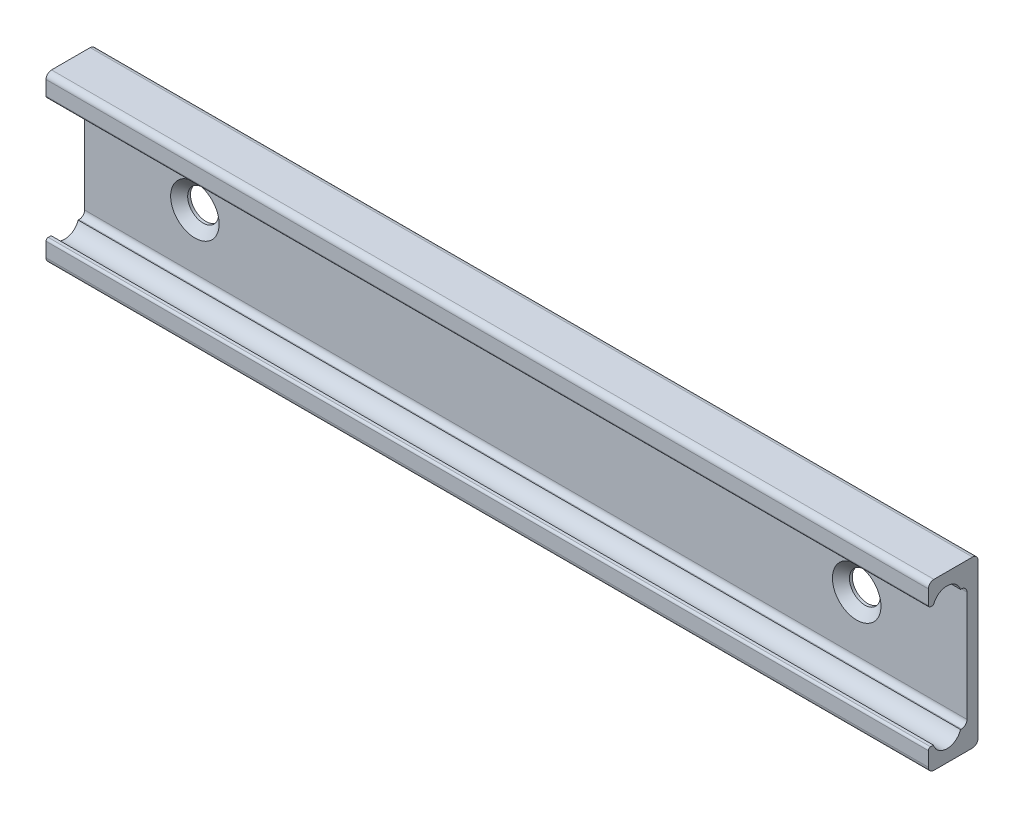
ISO-10303-21;
HEADER;
FILE_DESCRIPTION(('STEP AP214'),'2;1');
FILE_NAME('part.step','',(''),(''),'','','');
FILE_SCHEMA(('AUTOMOTIVE_DESIGN { 1 0 10303 214 1 1 1 1 }'));
ENDSEC;
DATA;
#1=APPLICATION_CONTEXT('core data for automotive mechanical design processes');
#2=APPLICATION_PROTOCOL_DEFINITION('international standard','automotive_design',2000,#1);
#3=PRODUCT_CONTEXT('',#1,'mechanical');
#4=PRODUCT('Part','Part','',(#3));
#5=PRODUCT_RELATED_PRODUCT_CATEGORY('part','',(#4));
#6=PRODUCT_DEFINITION_FORMATION('','',#4);
#7=PRODUCT_DEFINITION_CONTEXT('part definition',#1,'design');
#8=PRODUCT_DEFINITION('design','',#6,#7);
#9=PRODUCT_DEFINITION_SHAPE('','',#8);
#10=(LENGTH_UNIT() NAMED_UNIT(*) SI_UNIT(.MILLI.,.METRE.));
#11=(NAMED_UNIT(*) PLANE_ANGLE_UNIT() SI_UNIT($,.RADIAN.));
#12=(NAMED_UNIT(*) SI_UNIT($,.STERADIAN.) SOLID_ANGLE_UNIT());
#13=UNCERTAINTY_MEASURE_WITH_UNIT(LENGTH_MEASURE(1.E-05),#10,'distance_accuracy_value','');
#14=(GEOMETRIC_REPRESENTATION_CONTEXT(3) GLOBAL_UNCERTAINTY_ASSIGNED_CONTEXT((#13)) GLOBAL_UNIT_ASSIGNED_CONTEXT((#10,
#11,#12)) REPRESENTATION_CONTEXT('',''));
#15=CARTESIAN_POINT('',(0.,0.,0.));
#16=DIRECTION('',(0.,0.,1.));
#17=DIRECTION('',(1.,0.,0.));
#18=AXIS2_PLACEMENT_3D('',#15,#16,#17);
#19=CARTESIAN_POINT('',(70.,5.69999999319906,4.5));
#20=DIRECTION('',(0.,0.,1.));
#21=DIRECTION('',(1.,0.,0.));
#22=AXIS2_PLACEMENT_3D('',#19,#20,#21);
#23=PLANE('',#22);
#24=DIRECTION('',(0.,1.,0.));
#25=VECTOR('',#24,1.);
#26=CARTESIAN_POINT('',(-10.,5.69999999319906,4.5));
#27=LINE('',#26,#25);
#28=CARTESIAN_POINT('',(-10.,5.69999999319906,4.5));
#29=VERTEX_POINT('',#28);
#30=CARTESIAN_POINT('',(-10.,7.,4.5));
#31=VERTEX_POINT('',#30);
#32=EDGE_CURVE('E258',#29,#31,#27,.T.);
#33=ORIENTED_EDGE('',*,*,#32,.F.);
#34=DIRECTION('',(-1.,0.,0.));
#35=VECTOR('',#34,1.);
#36=CARTESIAN_POINT('',(70.,5.69999999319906,4.5));
#37=LINE('',#36,#35);
#38=CARTESIAN_POINT('',(70.,5.69999999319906,4.5));
#39=VERTEX_POINT('',#38);
#40=EDGE_CURVE('E9',#39,#29,#37,.T.);
#41=ORIENTED_EDGE('',*,*,#40,.F.);
#42=DIRECTION('',(0.,1.,0.));
#43=VECTOR('',#42,1.);
#44=CARTESIAN_POINT('',(70.,5.69999999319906,4.5));
#45=LINE('',#44,#43);
#46=CARTESIAN_POINT('',(70.,7.,4.5));
#47=VERTEX_POINT('',#46);
#48=EDGE_CURVE('E197',#39,#47,#45,.T.);
#49=ORIENTED_EDGE('',*,*,#48,.T.);
#50=DIRECTION('',(-1.,0.,0.));
#51=VECTOR('',#50,1.);
#52=CARTESIAN_POINT('',(74.5334865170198,7.,4.5));
#53=LINE('',#52,#51);
#54=EDGE_CURVE('E302',#47,#31,#53,.T.);
#55=ORIENTED_EDGE('',*,*,#54,.T.);
#56=EDGE_LOOP('',(#33,#41,#49,#55));
#57=FACE_BOUND('',#56,.T.);
#58=ADVANCED_FACE('F14',(#57),#23,.T.);
#59=CARTESIAN_POINT('',(70.,5.69999999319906,4.3));
#60=DIRECTION('',(-1.,0.,0.));
#61=DIRECTION('',(0.,0.,1.));
#62=AXIS2_PLACEMENT_3D('',#59,#60,#61);
#63=CYLINDRICAL_SURFACE('',#62,0.2);
#64=CARTESIAN_POINT('',(-10.,5.69999999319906,4.3));
#65=DIRECTION('',(-1.,0.,0.));
#66=DIRECTION('',(0.,0.,-1.));
#67=AXIS2_PLACEMENT_3D('',#64,#65,#66);
#68=CIRCLE('',#67,0.2);
#69=CARTESIAN_POINT('',(-10.,5.49999999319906,4.3));
#70=VERTEX_POINT('',#69);
#71=EDGE_CURVE('E255',#70,#29,#68,.T.);
#72=ORIENTED_EDGE('',*,*,#71,.F.);
#73=DIRECTION('',(-1.,0.,0.));
#74=VECTOR('',#73,1.);
#75=CARTESIAN_POINT('',(70.,5.49999999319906,4.3));
#76=LINE('',#75,#74);
#77=CARTESIAN_POINT('',(70.,5.49999999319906,4.3));
#78=VERTEX_POINT('',#77);
#79=EDGE_CURVE('E23',#78,#70,#76,.T.);
#80=ORIENTED_EDGE('',*,*,#79,.F.);
#81=CARTESIAN_POINT('',(70.,5.69999999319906,4.3));
#82=DIRECTION('',(-1.,0.,0.));
#83=DIRECTION('',(0.,0.,-1.));
#84=AXIS2_PLACEMENT_3D('',#81,#82,#83);
#85=CIRCLE('',#84,0.2);
#86=EDGE_CURVE('E194',#78,#39,#85,.T.);
#87=ORIENTED_EDGE('',*,*,#86,.T.);
#88=ORIENTED_EDGE('',*,*,#40,.T.);
#89=EDGE_LOOP('',(#72,#80,#87,#88));
#90=FACE_BOUND('',#89,.T.);
#91=ADVANCED_FACE('F352',(#90),#63,.T.);
#92=CARTESIAN_POINT('',(70.,5.49999999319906,3.97687617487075));
#93=DIRECTION('',(0.,-1.,0.));
#94=DIRECTION('',(1.,0.,0.));
#95=AXIS2_PLACEMENT_3D('',#92,#93,#94);
#96=PLANE('',#95);
#97=DIRECTION('',(-1.,0.,0.));
#98=VECTOR('',#97,1.);
#99=CARTESIAN_POINT('',(70.,5.49999999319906,4.03641754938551));
#100=LINE('',#99,#98);
#101=CARTESIAN_POINT('',(70.,5.49999999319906,4.03641754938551));
#102=VERTEX_POINT('',#101);
#103=CARTESIAN_POINT('',(-10.,5.49999999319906,4.03641754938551));
#104=VERTEX_POINT('',#103);
#105=EDGE_CURVE('E31',#102,#104,#100,.T.);
#106=ORIENTED_EDGE('',*,*,#105,.F.);
#107=DIRECTION('',(0.,0.,1.));
#108=VECTOR('',#107,1.);
#109=CARTESIAN_POINT('',(70.,5.49999999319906,3.97687617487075));
#110=LINE('',#109,#108);
#111=EDGE_CURVE('E192',#102,#78,#110,.T.);
#112=ORIENTED_EDGE('',*,*,#111,.T.);
#113=ORIENTED_EDGE('',*,*,#79,.T.);
#114=DIRECTION('',(0.,0.,1.));
#115=VECTOR('',#114,1.);
#116=CARTESIAN_POINT('',(-10.,5.49999999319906,3.97687617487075));
#117=LINE('',#116,#115);
#118=EDGE_CURVE('E253',#104,#70,#117,.T.);
#119=ORIENTED_EDGE('',*,*,#118,.F.);
#120=EDGE_LOOP('',(#106,#112,#113,#119));
#121=FACE_BOUND('',#120,.T.);
#122=ADVANCED_FACE('F359',(#121),#96,.T.);
#123=CARTESIAN_POINT('',(70.,5.5,1.5));
#124=DIRECTION('',(0.,-1.,-4.7517935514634E-08));
#125=DIRECTION('',(0.,-4.7517935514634E-08,1.));
#126=AXIS2_PLACEMENT_3D('',#123,#124,#125);
#127=PLANE('',#126);
#128=DIRECTION('',(-1.,0.,0.));
#129=VECTOR('',#128,1.);
#130=CARTESIAN_POINT('',(70.,5.49999999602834,1.58358245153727));
#131=LINE('',#130,#129);
#132=CARTESIAN_POINT('',(-10.,5.49999999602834,1.58358245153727));
#133=VERTEX_POINT('',#132);
#134=CARTESIAN_POINT('',(70.,5.49999999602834,1.58358245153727));
#135=VERTEX_POINT('',#134);
#136=EDGE_CURVE('E168',#133,#135,#131,.F.);
#137=ORIENTED_EDGE('',*,*,#136,.F.);
#138=DIRECTION('',(0.,-4.7517935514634E-08,1.));
#139=VECTOR('',#138,1.);
#140=CARTESIAN_POINT('',(-10.,5.5,1.5));
#141=LINE('',#140,#139);
#142=CARTESIAN_POINT('',(-10.,5.5,1.5));
#143=VERTEX_POINT('',#142);
#144=EDGE_CURVE('E250',#143,#133,#141,.T.);
#145=ORIENTED_EDGE('',*,*,#144,.F.);
#146=DIRECTION('',(-1.,0.,0.));
#147=VECTOR('',#146,1.);
#148=CARTESIAN_POINT('',(70.,5.5,1.5));
#149=LINE('',#148,#147);
#150=CARTESIAN_POINT('',(70.,5.5,1.5));
#151=VERTEX_POINT('',#150);
#152=EDGE_CURVE('E202',#151,#143,#149,.T.);
#153=ORIENTED_EDGE('',*,*,#152,.F.);
#154=DIRECTION('',(0.,-4.7517935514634E-08,1.));
#155=VECTOR('',#154,1.);
#156=CARTESIAN_POINT('',(70.,5.5,1.5));
#157=LINE('',#156,#155);
#158=EDGE_CURVE('E189',#151,#135,#157,.T.);
#159=ORIENTED_EDGE('',*,*,#158,.T.);
#160=EDGE_LOOP('',(#137,#145,#153,#159));
#161=FACE_BOUND('',#160,.T.);
#162=ADVANCED_FACE('F368',(#161),#127,.T.);
#163=CARTESIAN_POINT('',(70.,5.,1.5));
#164=DIRECTION('',(-1.,0.,0.));
#165=DIRECTION('',(0.,0.,1.));
#166=AXIS2_PLACEMENT_3D('',#163,#164,#165);
#167=CYLINDRICAL_SURFACE('',#166,0.5);
#168=CARTESIAN_POINT('',(-10.,5.,1.5));
#169=DIRECTION('',(1.,0.,0.));
#170=DIRECTION('',(0.,0.,1.));
#171=AXIS2_PLACEMENT_3D('',#168,#169,#170);
#172=CIRCLE('',#171,0.5);
#173=CARTESIAN_POINT('',(-10.,5.,1.));
#174=VERTEX_POINT('',#173);
#175=EDGE_CURVE('E247',#174,#143,#172,.T.);
#176=ORIENTED_EDGE('',*,*,#175,.F.);
#177=DIRECTION('',(-1.,0.,0.));
#178=VECTOR('',#177,1.);
#179=CARTESIAN_POINT('',(70.,5.,1.));
#180=LINE('',#179,#178);
#181=CARTESIAN_POINT('',(70.,5.,1.));
#182=VERTEX_POINT('',#181);
#183=EDGE_CURVE('E204',#182,#174,#180,.T.);
#184=ORIENTED_EDGE('',*,*,#183,.F.);
#185=CARTESIAN_POINT('',(70.,5.,1.5));
#186=DIRECTION('',(1.,0.,0.));
#187=DIRECTION('',(0.,0.,1.));
#188=AXIS2_PLACEMENT_3D('',#185,#186,#187);
#189=CIRCLE('',#188,0.5);
#190=EDGE_CURVE('E186',#182,#151,#189,.T.);
#191=ORIENTED_EDGE('',*,*,#190,.T.);
#192=ORIENTED_EDGE('',*,*,#152,.T.);
#193=EDGE_LOOP('',(#176,#184,#191,#192));
#194=FACE_BOUND('',#193,.T.);
#195=ADVANCED_FACE('F372',(#194),#167,.F.);
#196=CARTESIAN_POINT('',(70.,-5.,1.));
#197=DIRECTION('',(0.,0.,1.));
#198=DIRECTION('',(1.,0.,0.));
#199=AXIS2_PLACEMENT_3D('',#196,#197,#198);
#200=PLANE('',#199);
#201=CARTESIAN_POINT('',(60.,0.,1.));
#202=DIRECTION('',(0.,0.,1.));
#203=DIRECTION('',(1.,0.,0.));
#204=AXIS2_PLACEMENT_3D('',#201,#202,#203);
#205=CIRCLE('',#204,2.2);
#206=CARTESIAN_POINT('',(62.2,0.,1.));
#207=VERTEX_POINT('',#206);
#208=EDGE_CURVE('E222',#207,#207,#205,.T.);
#209=ORIENTED_EDGE('',*,*,#208,.F.);
#210=EDGE_LOOP('',(#209));
#211=FACE_BOUND('',#210,.T.);
#212=CARTESIAN_POINT('',(0.,0.,1.));
#213=DIRECTION('',(0.,0.,1.));
#214=DIRECTION('',(1.,0.,0.));
#215=AXIS2_PLACEMENT_3D('',#212,#213,#214);
#216=CIRCLE('',#215,2.2);
#217=CARTESIAN_POINT('',(2.2,0.,1.));
#218=VERTEX_POINT('',#217);
#219=EDGE_CURVE('E214',#218,#218,#216,.T.);
#220=ORIENTED_EDGE('',*,*,#219,.F.);
#221=EDGE_LOOP('',(#220));
#222=FACE_BOUND('',#221,.T.);
#223=DIRECTION('',(0.,1.,0.));
#224=VECTOR('',#223,1.);
#225=CARTESIAN_POINT('',(-10.,-5.,1.));
#226=LINE('',#225,#224);
#227=CARTESIAN_POINT('',(-10.,-5.,1.));
#228=VERTEX_POINT('',#227);
#229=EDGE_CURVE('E244',#228,#174,#226,.T.);
#230=ORIENTED_EDGE('',*,*,#229,.F.);
#231=DIRECTION('',(-1.,0.,0.));
#232=VECTOR('',#231,1.);
#233=CARTESIAN_POINT('',(70.,-5.,1.));
#234=LINE('',#233,#232);
#235=CARTESIAN_POINT('',(70.,-5.,1.));
#236=VERTEX_POINT('',#235);
#237=EDGE_CURVE('E206',#236,#228,#234,.T.);
#238=ORIENTED_EDGE('',*,*,#237,.F.);
#239=DIRECTION('',(0.,1.,0.));
#240=VECTOR('',#239,1.);
#241=CARTESIAN_POINT('',(70.,-5.,1.));
#242=LINE('',#241,#240);
#243=EDGE_CURVE('E178',#236,#182,#242,.T.);
#244=ORIENTED_EDGE('',*,*,#243,.T.);
#245=ORIENTED_EDGE('',*,*,#183,.T.);
#246=EDGE_LOOP('',(#230,#238,#244,#245));
#247=FACE_BOUND('',#246,.T.);
#248=ADVANCED_FACE('F376',(#211,#222,#247),#200,.T.);
#249=CARTESIAN_POINT('',(70.,-5.,1.5));
#250=DIRECTION('',(-1.,0.,0.));
#251=DIRECTION('',(0.,0.,1.));
#252=AXIS2_PLACEMENT_3D('',#249,#250,#251);
#253=CYLINDRICAL_SURFACE('',#252,0.5);
#254=CARTESIAN_POINT('',(-10.,-5.,1.5));
#255=DIRECTION('',(1.,0.,0.));
#256=DIRECTION('',(0.,0.,-1.));
#257=AXIS2_PLACEMENT_3D('',#254,#255,#256);
#258=CIRCLE('',#257,0.5);
#259=CARTESIAN_POINT('',(-10.,-5.5,1.5));
#260=VERTEX_POINT('',#259);
#261=EDGE_CURVE('E241',#260,#228,#258,.T.);
#262=ORIENTED_EDGE('',*,*,#261,.F.);
#263=DIRECTION('',(-1.,0.,0.));
#264=VECTOR('',#263,1.);
#265=CARTESIAN_POINT('',(70.,-5.5,1.5));
#266=LINE('',#265,#264);
#267=CARTESIAN_POINT('',(70.,-5.5,1.5));
#268=VERTEX_POINT('',#267);
#269=EDGE_CURVE('E208',#268,#260,#266,.T.);
#270=ORIENTED_EDGE('',*,*,#269,.F.);
#271=CARTESIAN_POINT('',(70.,-5.,1.5));
#272=DIRECTION('',(1.,0.,0.));
#273=DIRECTION('',(0.,0.,-1.));
#274=AXIS2_PLACEMENT_3D('',#271,#272,#273);
#275=CIRCLE('',#274,0.5);
#276=EDGE_CURVE('E175',#268,#236,#275,.T.);
#277=ORIENTED_EDGE('',*,*,#276,.T.);
#278=ORIENTED_EDGE('',*,*,#237,.T.);
#279=EDGE_LOOP('',(#262,#270,#277,#278));
#280=FACE_BOUND('',#279,.T.);
#281=ADVANCED_FACE('F380',(#280),#253,.F.);
#282=CARTESIAN_POINT('',(70.,-5.5,1.5));
#283=DIRECTION('',(0.,1.,-4.7517935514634E-08));
#284=DIRECTION('',(0.,-4.7517935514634E-08,-1.));
#285=AXIS2_PLACEMENT_3D('',#282,#283,#284);
#286=PLANE('',#285);
#287=DIRECTION('',(-1.,0.,0.));
#288=VECTOR('',#287,1.);
#289=CARTESIAN_POINT('',(70.,-5.49999999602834,1.58358245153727));
#290=LINE('',#289,#288);
#291=CARTESIAN_POINT('',(70.,-5.49999999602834,1.58358245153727));
#292=VERTEX_POINT('',#291);
#293=CARTESIAN_POINT('',(-10.,-5.49999999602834,1.58358245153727));
#294=VERTEX_POINT('',#293);
#295=EDGE_CURVE('E39',#292,#294,#290,.T.);
#296=ORIENTED_EDGE('',*,*,#295,.F.);
#297=DIRECTION('',(0.,-4.7517935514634E-08,-1.));
#298=VECTOR('',#297,1.);
#299=CARTESIAN_POINT('',(70.,-5.5,1.5));
#300=LINE('',#299,#298);
#301=EDGE_CURVE('E165',#292,#268,#300,.T.);
#302=ORIENTED_EDGE('',*,*,#301,.T.);
#303=ORIENTED_EDGE('',*,*,#269,.T.);
#304=DIRECTION('',(0.,-4.7517935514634E-08,-1.));
#305=VECTOR('',#304,1.);
#306=CARTESIAN_POINT('',(-10.,-5.5,1.5));
#307=LINE('',#306,#305);
#308=EDGE_CURVE('E167',#294,#260,#307,.T.);
#309=ORIENTED_EDGE('',*,*,#308,.F.);
#310=EDGE_LOOP('',(#296,#302,#303,#309));
#311=FACE_BOUND('',#310,.T.);
#312=ADVANCED_FACE('F163',(#311),#286,.T.);
#313=CARTESIAN_POINT('',(70.,-5.49999999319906,3.97687617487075));
#314=DIRECTION('',(0.,1.,0.));
#315=DIRECTION('',(-1.,0.,0.));
#316=AXIS2_PLACEMENT_3D('',#313,#314,#315);
#317=PLANE('',#316);
#318=DIRECTION('',(-1.,0.,0.));
#319=VECTOR('',#318,1.);
#320=CARTESIAN_POINT('',(70.,-5.49999999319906,4.03641754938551));
#321=LINE('',#320,#319);
#322=CARTESIAN_POINT('',(-10.,-5.49999999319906,4.03641754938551));
#323=VERTEX_POINT('',#322);
#324=CARTESIAN_POINT('',(70.,-5.49999999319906,4.03641754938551));
#325=VERTEX_POINT('',#324);
#326=EDGE_CURVE('E153',#323,#325,#321,.F.);
#327=ORIENTED_EDGE('',*,*,#326,.F.);
#328=DIRECTION('',(0.,0.,-1.));
#329=VECTOR('',#328,1.);
#330=CARTESIAN_POINT('',(-10.,-5.49999999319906,3.97687617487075));
#331=LINE('',#330,#329);
#332=CARTESIAN_POINT('',(-10.,-5.49999999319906,4.3));
#333=VERTEX_POINT('',#332);
#334=EDGE_CURVE('E237',#333,#323,#331,.T.);
#335=ORIENTED_EDGE('',*,*,#334,.F.);
#336=DIRECTION('',(-1.,0.,0.));
#337=VECTOR('',#336,1.);
#338=CARTESIAN_POINT('',(70.,-5.49999999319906,4.3));
#339=LINE('',#338,#337);
#340=CARTESIAN_POINT('',(70.,-5.49999999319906,4.3));
#341=VERTEX_POINT('',#340);
#342=EDGE_CURVE('E210',#341,#333,#339,.T.);
#343=ORIENTED_EDGE('',*,*,#342,.F.);
#344=DIRECTION('',(0.,0.,-1.));
#345=VECTOR('',#344,1.);
#346=CARTESIAN_POINT('',(70.,-5.49999999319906,3.97687617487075));
#347=LINE('',#346,#345);
#348=EDGE_CURVE('E176',#341,#325,#347,.T.);
#349=ORIENTED_EDGE('',*,*,#348,.T.);
#350=EDGE_LOOP('',(#327,#335,#343,#349));
#351=FACE_BOUND('',#350,.T.);
#352=ADVANCED_FACE('F387',(#351),#317,.T.);
#353=CARTESIAN_POINT('',(70.,-5.69999999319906,4.3));
#354=DIRECTION('',(-1.,0.,0.));
#355=DIRECTION('',(0.,0.,1.));
#356=AXIS2_PLACEMENT_3D('',#353,#354,#355);
#357=CYLINDRICAL_SURFACE('',#356,0.2);
#358=CARTESIAN_POINT('',(-10.,-5.69999999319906,4.3));
#359=DIRECTION('',(-1.,0.,0.));
#360=DIRECTION('',(0.,0.,1.));
#361=AXIS2_PLACEMENT_3D('',#358,#359,#360);
#362=CIRCLE('',#361,0.2);
#363=CARTESIAN_POINT('',(-10.,-5.69999999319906,4.5));
#364=VERTEX_POINT('',#363);
#365=EDGE_CURVE('E234',#364,#333,#362,.T.);
#366=ORIENTED_EDGE('',*,*,#365,.F.);
#367=DIRECTION('',(-1.,0.,0.));
#368=VECTOR('',#367,1.);
#369=CARTESIAN_POINT('',(70.,-5.69999999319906,4.5));
#370=LINE('',#369,#368);
#371=CARTESIAN_POINT('',(70.,-5.69999999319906,4.5));
#372=VERTEX_POINT('',#371);
#373=EDGE_CURVE('E198',#372,#364,#370,.T.);
#374=ORIENTED_EDGE('',*,*,#373,.F.);
#375=CARTESIAN_POINT('',(70.,-5.69999999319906,4.3));
#376=DIRECTION('',(-1.,0.,0.));
#377=DIRECTION('',(0.,0.,1.));
#378=AXIS2_PLACEMENT_3D('',#375,#376,#377);
#379=CIRCLE('',#378,0.2);
#380=EDGE_CURVE('E180',#372,#341,#379,.T.);
#381=ORIENTED_EDGE('',*,*,#380,.T.);
#382=ORIENTED_EDGE('',*,*,#342,.T.);
#383=EDGE_LOOP('',(#366,#374,#381,#382));
#384=FACE_BOUND('',#383,.T.);
#385=ADVANCED_FACE('F268',(#384),#357,.T.);
#386=CARTESIAN_POINT('',(70.,-5.69999999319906,4.5));
#387=DIRECTION('',(0.,0.,1.));
#388=DIRECTION('',(1.,0.,0.));
#389=AXIS2_PLACEMENT_3D('',#386,#387,#388);
#390=PLANE('',#389);
#391=DIRECTION('',(0.,1.,0.));
#392=VECTOR('',#391,1.);
#393=CARTESIAN_POINT('',(-10.,-5.69999999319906,4.5));
#394=LINE('',#393,#392);
#395=CARTESIAN_POINT('',(-10.,-7.,4.5));
#396=VERTEX_POINT('',#395);
#397=EDGE_CURVE('E231',#396,#364,#394,.T.);
#398=ORIENTED_EDGE('',*,*,#397,.F.);
#399=DIRECTION('',(-1.,0.,0.));
#400=VECTOR('',#399,1.);
#401=CARTESIAN_POINT('',(74.5334865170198,-7.,4.5));
#402=LINE('',#401,#400);
#403=CARTESIAN_POINT('',(70.,-7.,4.5));
#404=VERTEX_POINT('',#403);
#405=EDGE_CURVE('E274',#404,#396,#402,.T.);
#406=ORIENTED_EDGE('',*,*,#405,.F.);
#407=DIRECTION('',(0.,1.,0.));
#408=VECTOR('',#407,1.);
#409=CARTESIAN_POINT('',(70.,-5.69999999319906,4.5));
#410=LINE('',#409,#408);
#411=EDGE_CURVE('E262',#404,#372,#410,.T.);
#412=ORIENTED_EDGE('',*,*,#411,.T.);
#413=ORIENTED_EDGE('',*,*,#373,.T.);
#414=EDGE_LOOP('',(#398,#406,#412,#413));
#415=FACE_BOUND('',#414,.T.);
#416=ADVANCED_FACE('F272',(#415),#390,.T.);
#417=CARTESIAN_POINT('',(70.,-6.95,0.));
#418=DIRECTION('',(0.,0.,-1.));
#419=DIRECTION('',(-1.,0.,0.));
#420=AXIS2_PLACEMENT_3D('',#417,#418,#419);
#421=PLANE('',#420);
#422=CARTESIAN_POINT('',(60.,0.,0.));
#423=DIRECTION('',(0.,0.,1.));
#424=DIRECTION('',(1.,0.,0.));
#425=AXIS2_PLACEMENT_3D('',#422,#423,#424);
#426=CIRCLE('',#425,1.4);
#427=CARTESIAN_POINT('',(61.4,0.,0.));
#428=VERTEX_POINT('',#427);
#429=EDGE_CURVE('E322',#428,#428,#426,.T.);
#430=ORIENTED_EDGE('',*,*,#429,.T.);
#431=EDGE_LOOP('',(#430));
#432=FACE_BOUND('',#431,.T.);
#433=CARTESIAN_POINT('',(0.,0.,0.));
#434=DIRECTION('',(0.,0.,1.));
#435=DIRECTION('',(1.,0.,0.));
#436=AXIS2_PLACEMENT_3D('',#433,#434,#435);
#437=CIRCLE('',#436,1.4);
#438=CARTESIAN_POINT('',(1.4,0.,0.));
#439=VERTEX_POINT('',#438);
#440=EDGE_CURVE('E215',#439,#439,#437,.T.);
#441=ORIENTED_EDGE('',*,*,#440,.T.);
#442=EDGE_LOOP('',(#441));
#443=FACE_BOUND('',#442,.T.);
#444=DIRECTION('',(0.,-1.,0.));
#445=VECTOR('',#444,1.);
#446=CARTESIAN_POINT('',(-10.,-6.95,0.));
#447=LINE('',#446,#445);
#448=CARTESIAN_POINT('',(-10.,7.,0.));
#449=VERTEX_POINT('',#448);
#450=CARTESIAN_POINT('',(-10.,-7.,0.));
#451=VERTEX_POINT('',#450);
#452=EDGE_CURVE('E219',#449,#451,#447,.T.);
#453=ORIENTED_EDGE('',*,*,#452,.F.);
#454=DIRECTION('',(-1.,0.,0.));
#455=VECTOR('',#454,1.);
#456=CARTESIAN_POINT('',(74.5334865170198,7.,0.));
#457=LINE('',#456,#455);
#458=CARTESIAN_POINT('',(70.,7.,0.));
#459=VERTEX_POINT('',#458);
#460=EDGE_CURVE('E311',#459,#449,#457,.T.);
#461=ORIENTED_EDGE('',*,*,#460,.F.);
#462=DIRECTION('',(0.,-1.,0.));
#463=VECTOR('',#462,1.);
#464=CARTESIAN_POINT('',(70.,-6.95,0.));
#465=LINE('',#464,#463);
#466=CARTESIAN_POINT('',(70.,-7.,0.));
#467=VERTEX_POINT('',#466);
#468=EDGE_CURVE('E260',#459,#467,#465,.T.);
#469=ORIENTED_EDGE('',*,*,#468,.T.);
#470=DIRECTION('',(-1.,0.,0.));
#471=VECTOR('',#470,1.);
#472=CARTESIAN_POINT('',(74.5334865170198,-7.,0.));
#473=LINE('',#472,#471);
#474=EDGE_CURVE('E279',#467,#451,#473,.T.);
#475=ORIENTED_EDGE('',*,*,#474,.T.);
#476=EDGE_LOOP('',(#453,#461,#469,#475));
#477=FACE_BOUND('',#476,.T.);
#478=ADVANCED_FACE('F16',(#432,#443,#477),#421,.T.);
#479=CARTESIAN_POINT('',(70.,6.95,0.5));
#480=DIRECTION('',(1.,0.,0.));
#481=DIRECTION('',(0.,0.,-1.));
#482=AXIS2_PLACEMENT_3D('',#479,#480,#481);
#483=PLANE('',#482);
#484=CARTESIAN_POINT('',(70.,5.1,2.81));
#485=DIRECTION('',(-1.,0.,0.));
#486=DIRECTION('',(0.,0.,1.));
#487=AXIS2_PLACEMENT_3D('',#484,#485,#486);
#488=CIRCLE('',#487,1.29);
#489=EDGE_CURVE('E435',#102,#135,#488,.T.);
#490=ORIENTED_EDGE('',*,*,#489,.T.);
#491=ORIENTED_EDGE('',*,*,#158,.F.);
#492=ORIENTED_EDGE('',*,*,#190,.F.);
#493=ORIENTED_EDGE('',*,*,#243,.F.);
#494=ORIENTED_EDGE('',*,*,#276,.F.);
#495=ORIENTED_EDGE('',*,*,#301,.F.);
#496=CARTESIAN_POINT('',(70.,-5.1,2.81));
#497=DIRECTION('',(-1.,0.,0.));
#498=DIRECTION('',(0.,0.,-1.));
#499=AXIS2_PLACEMENT_3D('',#496,#497,#498);
#500=CIRCLE('',#499,1.29);
#501=EDGE_CURVE('E150',#292,#325,#500,.T.);
#502=ORIENTED_EDGE('',*,*,#501,.T.);
#503=ORIENTED_EDGE('',*,*,#348,.F.);
#504=ORIENTED_EDGE('',*,*,#380,.F.);
#505=ORIENTED_EDGE('',*,*,#411,.F.);
#506=CARTESIAN_POINT('',(70.,-7.,4.));
#507=DIRECTION('',(1.,0.,0.));
#508=DIRECTION('',(0.,0.,-1.));
#509=AXIS2_PLACEMENT_3D('',#506,#507,#508);
#510=CIRCLE('',#509,0.5);
#511=CARTESIAN_POINT('',(70.,-7.5,4.));
#512=VERTEX_POINT('',#511);
#513=EDGE_CURVE('E280',#512,#404,#510,.F.);
#514=ORIENTED_EDGE('',*,*,#513,.F.);
#515=DIRECTION('',(0.,0.,1.));
#516=VECTOR('',#515,1.);
#517=CARTESIAN_POINT('',(70.,-7.5,0.5));
#518=LINE('',#517,#516);
#519=CARTESIAN_POINT('',(70.,-7.5,0.5));
#520=VERTEX_POINT('',#519);
#521=EDGE_CURVE('E287',#520,#512,#518,.T.);
#522=ORIENTED_EDGE('',*,*,#521,.F.);
#523=CARTESIAN_POINT('',(70.,-7.,0.5));
#524=DIRECTION('',(1.,0.,0.));
#525=DIRECTION('',(0.,0.,-1.));
#526=AXIS2_PLACEMENT_3D('',#523,#524,#525);
#527=CIRCLE('',#526,0.5);
#528=EDGE_CURVE('E291',#467,#520,#527,.F.);
#529=ORIENTED_EDGE('',*,*,#528,.F.);
#530=ORIENTED_EDGE('',*,*,#468,.F.);
#531=CARTESIAN_POINT('',(70.,7.,0.5));
#532=DIRECTION('',(1.,0.,0.));
#533=DIRECTION('',(0.,0.,-1.));
#534=AXIS2_PLACEMENT_3D('',#531,#532,#533);
#535=CIRCLE('',#534,0.5);
#536=CARTESIAN_POINT('',(70.,7.5,0.5));
#537=VERTEX_POINT('',#536);
#538=EDGE_CURVE('E308',#537,#459,#535,.F.);
#539=ORIENTED_EDGE('',*,*,#538,.F.);
#540=DIRECTION('',(0.,0.,-1.));
#541=VECTOR('',#540,1.);
#542=CARTESIAN_POINT('',(70.,7.5,0.5));
#543=LINE('',#542,#541);
#544=CARTESIAN_POINT('',(70.,7.5,4.));
#545=VERTEX_POINT('',#544);
#546=EDGE_CURVE('E313',#545,#537,#543,.T.);
#547=ORIENTED_EDGE('',*,*,#546,.F.);
#548=CARTESIAN_POINT('',(70.,7.,4.));
#549=DIRECTION('',(1.,0.,0.));
#550=DIRECTION('',(0.,0.,-1.));
#551=AXIS2_PLACEMENT_3D('',#548,#549,#550);
#552=CIRCLE('',#551,0.5);
#553=EDGE_CURVE('E317',#47,#545,#552,.F.);
#554=ORIENTED_EDGE('',*,*,#553,.F.);
#555=ORIENTED_EDGE('',*,*,#48,.F.);
#556=ORIENTED_EDGE('',*,*,#86,.F.);
#557=ORIENTED_EDGE('',*,*,#111,.F.);
#558=EDGE_LOOP('',(#490,#491,#492,#493,#494,#495,#502,#503,#504,#505,#514,#522,#529,#530,#539,
#547,#554,#555,#556,#557));
#559=FACE_BOUND('',#558,.T.);
#560=ADVANCED_FACE('F172',(#559),#483,.T.);
#561=CARTESIAN_POINT('',(-10.,6.95,0.5));
#562=DIRECTION('',(1.,0.,0.));
#563=DIRECTION('',(0.,0.,-1.));
#564=AXIS2_PLACEMENT_3D('',#561,#562,#563);
#565=PLANE('',#564);
#566=ORIENTED_EDGE('',*,*,#144,.T.);
#567=CARTESIAN_POINT('',(-10.,5.1,2.81));
#568=DIRECTION('',(-1.,0.,0.));
#569=DIRECTION('',(0.,0.,1.));
#570=AXIS2_PLACEMENT_3D('',#567,#568,#569);
#571=CIRCLE('',#570,1.29);
#572=EDGE_CURVE('E158',#104,#133,#571,.T.);
#573=ORIENTED_EDGE('',*,*,#572,.F.);
#574=ORIENTED_EDGE('',*,*,#118,.T.);
#575=ORIENTED_EDGE('',*,*,#71,.T.);
#576=ORIENTED_EDGE('',*,*,#32,.T.);
#577=CARTESIAN_POINT('',(-10.,7.,4.));
#578=DIRECTION('',(-1.,0.,0.));
#579=DIRECTION('',(0.,0.,-1.));
#580=AXIS2_PLACEMENT_3D('',#577,#578,#579);
#581=CIRCLE('',#580,0.5);
#582=CARTESIAN_POINT('',(-10.,7.5,4.));
#583=VERTEX_POINT('',#582);
#584=EDGE_CURVE('E298',#31,#583,#581,.T.);
#585=ORIENTED_EDGE('',*,*,#584,.T.);
#586=DIRECTION('',(0.,0.,-1.));
#587=VECTOR('',#586,1.);
#588=CARTESIAN_POINT('',(-10.,7.5,0.5));
#589=LINE('',#588,#587);
#590=CARTESIAN_POINT('',(-10.,7.5,0.5));
#591=VERTEX_POINT('',#590);
#592=EDGE_CURVE('E303',#583,#591,#589,.T.);
#593=ORIENTED_EDGE('',*,*,#592,.T.);
#594=CARTESIAN_POINT('',(-10.,7.,0.5));
#595=DIRECTION('',(-1.,0.,0.));
#596=DIRECTION('',(0.,0.,1.));
#597=AXIS2_PLACEMENT_3D('',#594,#595,#596);
#598=CIRCLE('',#597,0.5);
#599=EDGE_CURVE('E299',#591,#449,#598,.T.);
#600=ORIENTED_EDGE('',*,*,#599,.T.);
#601=ORIENTED_EDGE('',*,*,#452,.T.);
#602=CARTESIAN_POINT('',(-10.,-7.,0.5));
#603=DIRECTION('',(-1.,0.,0.));
#604=DIRECTION('',(0.,0.,-1.));
#605=AXIS2_PLACEMENT_3D('',#602,#603,#604);
#606=CIRCLE('',#605,0.5);
#607=CARTESIAN_POINT('',(-10.,-7.5,0.5));
#608=VERTEX_POINT('',#607);
#609=EDGE_CURVE('E425',#451,#608,#606,.T.);
#610=ORIENTED_EDGE('',*,*,#609,.T.);
#611=DIRECTION('',(0.,0.,1.));
#612=VECTOR('',#611,1.);
#613=CARTESIAN_POINT('',(-10.,-7.5,0.5));
#614=LINE('',#613,#612);
#615=CARTESIAN_POINT('',(-10.,-7.5,4.));
#616=VERTEX_POINT('',#615);
#617=EDGE_CURVE('E428',#608,#616,#614,.T.);
#618=ORIENTED_EDGE('',*,*,#617,.T.);
#619=CARTESIAN_POINT('',(-10.,-7.,4.));
#620=DIRECTION('',(-1.,0.,0.));
#621=DIRECTION('',(0.,0.,-1.));
#622=AXIS2_PLACEMENT_3D('',#619,#620,#621);
#623=CIRCLE('',#622,0.5);
#624=EDGE_CURVE('E423',#616,#396,#623,.T.);
#625=ORIENTED_EDGE('',*,*,#624,.T.);
#626=ORIENTED_EDGE('',*,*,#397,.T.);
#627=ORIENTED_EDGE('',*,*,#365,.T.);
#628=ORIENTED_EDGE('',*,*,#334,.T.);
#629=CARTESIAN_POINT('',(-10.,-5.1,2.81));
#630=DIRECTION('',(-1.,0.,0.));
#631=DIRECTION('',(0.,0.,-1.));
#632=AXIS2_PLACEMENT_3D('',#629,#630,#631);
#633=CIRCLE('',#632,1.29);
#634=EDGE_CURVE('E159',#294,#323,#633,.T.);
#635=ORIENTED_EDGE('',*,*,#634,.F.);
#636=ORIENTED_EDGE('',*,*,#308,.T.);
#637=ORIENTED_EDGE('',*,*,#261,.T.);
#638=ORIENTED_EDGE('',*,*,#229,.T.);
#639=ORIENTED_EDGE('',*,*,#175,.T.);
#640=EDGE_LOOP('',(#566,#573,#574,#575,#576,#585,#593,#600,#601,#610,#618,#625,#626,#627,#628,
#635,#636,#637,#638,#639));
#641=FACE_BOUND('',#640,.T.);
#642=ADVANCED_FACE('F401',(#641),#565,.F.);
#643=CARTESIAN_POINT('',(0.,0.,1.));
#644=DIRECTION('',(0.,0.,1.));
#645=DIRECTION('',(1.,0.,0.));
#646=AXIS2_PLACEMENT_3D('',#643,#644,#645);
#647=CONICAL_SURFACE('',#646,2.2,0.820304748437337);
#648=CARTESIAN_POINT('',(0.,0.,0.253987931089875));
#649=DIRECTION('',(0.,0.,1.));
#650=DIRECTION('',(1.,0.,0.));
#651=AXIS2_PLACEMENT_3D('',#648,#649,#650);
#652=CIRCLE('',#651,1.4);
#653=CARTESIAN_POINT('',(1.4,0.,0.253987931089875));
#654=VERTEX_POINT('',#653);
#655=EDGE_CURVE('E212',#654,#654,#652,.F.);
#656=ORIENTED_EDGE('',*,*,#655,.T.);
#657=EDGE_LOOP('',(#656));
#658=FACE_BOUND('',#657,.T.);
#659=ORIENTED_EDGE('',*,*,#219,.T.);
#660=EDGE_LOOP('',(#659));
#661=FACE_BOUND('',#660,.T.);
#662=ADVANCED_FACE('F592',(#658,#661),#647,.F.);
#663=CARTESIAN_POINT('',(0.,0.,0.));
#664=DIRECTION('',(0.,0.,1.));
#665=DIRECTION('',(1.,0.,0.));
#666=AXIS2_PLACEMENT_3D('',#663,#664,#665);
#667=CYLINDRICAL_SURFACE('',#666,1.4);
#668=ORIENTED_EDGE('',*,*,#440,.F.);
#669=EDGE_LOOP('',(#668));
#670=FACE_BOUND('',#669,.T.);
#671=ORIENTED_EDGE('',*,*,#655,.F.);
#672=EDGE_LOOP('',(#671));
#673=FACE_BOUND('',#672,.T.);
#674=ADVANCED_FACE('F349',(#670,#673),#667,.F.);
#675=CARTESIAN_POINT('',(60.,0.,1.));
#676=DIRECTION('',(0.,0.,1.));
#677=DIRECTION('',(1.,0.,0.));
#678=AXIS2_PLACEMENT_3D('',#675,#676,#677);
#679=CONICAL_SURFACE('',#678,2.2,0.820304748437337);
#680=CARTESIAN_POINT('',(60.,0.,0.253987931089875));
#681=DIRECTION('',(0.,0.,1.));
#682=DIRECTION('',(1.,0.,0.));
#683=AXIS2_PLACEMENT_3D('',#680,#681,#682);
#684=CIRCLE('',#683,1.4);
#685=CARTESIAN_POINT('',(61.4,0.,0.253987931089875));
#686=VERTEX_POINT('',#685);
#687=EDGE_CURVE('E18',#686,#686,#684,.F.);
#688=ORIENTED_EDGE('',*,*,#687,.T.);
#689=EDGE_LOOP('',(#688));
#690=FACE_BOUND('',#689,.T.);
#691=ORIENTED_EDGE('',*,*,#208,.T.);
#692=EDGE_LOOP('',(#691));
#693=FACE_BOUND('',#692,.T.);
#694=ADVANCED_FACE('F332',(#690,#693),#679,.F.);
#695=CARTESIAN_POINT('',(60.,0.,0.));
#696=DIRECTION('',(0.,0.,1.));
#697=DIRECTION('',(1.,0.,0.));
#698=AXIS2_PLACEMENT_3D('',#695,#696,#697);
#699=CYLINDRICAL_SURFACE('',#698,1.4);
#700=ORIENTED_EDGE('',*,*,#429,.F.);
#701=EDGE_LOOP('',(#700));
#702=FACE_BOUND('',#701,.T.);
#703=ORIENTED_EDGE('',*,*,#687,.F.);
#704=EDGE_LOOP('',(#703));
#705=FACE_BOUND('',#704,.T.);
#706=ADVANCED_FACE('F335',(#702,#705),#699,.F.);
#707=CARTESIAN_POINT('',(74.5334865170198,7.,4.));
#708=DIRECTION('',(-1.,0.,0.));
#709=DIRECTION('',(0.,0.,1.));
#710=AXIS2_PLACEMENT_3D('',#707,#708,#709);
#711=CYLINDRICAL_SURFACE('',#710,0.5);
#712=ORIENTED_EDGE('',*,*,#54,.F.);
#713=ORIENTED_EDGE('',*,*,#553,.T.);
#714=DIRECTION('',(-1.,0.,0.));
#715=VECTOR('',#714,1.);
#716=CARTESIAN_POINT('',(74.5334865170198,7.5,4.));
#717=LINE('',#716,#715);
#718=EDGE_CURVE('E316',#545,#583,#717,.T.);
#719=ORIENTED_EDGE('',*,*,#718,.T.);
#720=ORIENTED_EDGE('',*,*,#584,.F.);
#721=EDGE_LOOP('',(#712,#713,#719,#720));
#722=FACE_BOUND('',#721,.T.);
#723=ADVANCED_FACE('F337',(#722),#711,.T.);
#724=CARTESIAN_POINT('',(74.5334865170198,7.5,0.5));
#725=DIRECTION('',(0.,1.,0.));
#726=DIRECTION('',(-1.,0.,0.));
#727=AXIS2_PLACEMENT_3D('',#724,#725,#726);
#728=PLANE('',#727);
#729=ORIENTED_EDGE('',*,*,#718,.F.);
#730=ORIENTED_EDGE('',*,*,#546,.T.);
#731=DIRECTION('',(-1.,0.,0.));
#732=VECTOR('',#731,1.);
#733=CARTESIAN_POINT('',(74.5334865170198,7.5,0.5));
#734=LINE('',#733,#732);
#735=EDGE_CURVE('E312',#537,#591,#734,.T.);
#736=ORIENTED_EDGE('',*,*,#735,.T.);
#737=ORIENTED_EDGE('',*,*,#592,.F.);
#738=EDGE_LOOP('',(#729,#730,#736,#737));
#739=FACE_BOUND('',#738,.T.);
#740=ADVANCED_FACE('F346',(#739),#728,.T.);
#741=CARTESIAN_POINT('',(74.5334865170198,7.,0.5));
#742=DIRECTION('',(-1.,0.,0.));
#743=DIRECTION('',(0.,0.,1.));
#744=AXIS2_PLACEMENT_3D('',#741,#742,#743);
#745=CYLINDRICAL_SURFACE('',#744,0.5);
#746=ORIENTED_EDGE('',*,*,#735,.F.);
#747=ORIENTED_EDGE('',*,*,#538,.T.);
#748=ORIENTED_EDGE('',*,*,#460,.T.);
#749=ORIENTED_EDGE('',*,*,#599,.F.);
#750=EDGE_LOOP('',(#746,#747,#748,#749));
#751=FACE_BOUND('',#750,.T.);
#752=ADVANCED_FACE('F411',(#751),#745,.T.);
#753=CARTESIAN_POINT('',(74.5334865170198,-7.,0.5));
#754=DIRECTION('',(-1.,0.,0.));
#755=DIRECTION('',(0.,0.,1.));
#756=AXIS2_PLACEMENT_3D('',#753,#754,#755);
#757=CYLINDRICAL_SURFACE('',#756,0.5);
#758=ORIENTED_EDGE('',*,*,#474,.F.);
#759=ORIENTED_EDGE('',*,*,#528,.T.);
#760=DIRECTION('',(-1.,0.,0.));
#761=VECTOR('',#760,1.);
#762=CARTESIAN_POINT('',(74.5334865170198,-7.5,0.5));
#763=LINE('',#762,#761);
#764=EDGE_CURVE('E293',#520,#608,#763,.T.);
#765=ORIENTED_EDGE('',*,*,#764,.T.);
#766=ORIENTED_EDGE('',*,*,#609,.F.);
#767=EDGE_LOOP('',(#758,#759,#765,#766));
#768=FACE_BOUND('',#767,.T.);
#769=ADVANCED_FACE('F424',(#768),#757,.T.);
#770=CARTESIAN_POINT('',(74.5334865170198,-7.5,0.5));
#771=DIRECTION('',(0.,-1.,0.));
#772=DIRECTION('',(0.,0.,1.));
#773=AXIS2_PLACEMENT_3D('',#770,#771,#772);
#774=PLANE('',#773);
#775=ORIENTED_EDGE('',*,*,#764,.F.);
#776=ORIENTED_EDGE('',*,*,#521,.T.);
#777=DIRECTION('',(-1.,0.,0.));
#778=VECTOR('',#777,1.);
#779=CARTESIAN_POINT('',(74.5334865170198,-7.5,4.));
#780=LINE('',#779,#778);
#781=EDGE_CURVE('E284',#512,#616,#780,.T.);
#782=ORIENTED_EDGE('',*,*,#781,.T.);
#783=ORIENTED_EDGE('',*,*,#617,.F.);
#784=EDGE_LOOP('',(#775,#776,#782,#783));
#785=FACE_BOUND('',#784,.T.);
#786=ADVANCED_FACE('F449',(#785),#774,.T.);
#787=CARTESIAN_POINT('',(74.5334865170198,-7.,4.));
#788=DIRECTION('',(-1.,0.,0.));
#789=DIRECTION('',(0.,0.,1.));
#790=AXIS2_PLACEMENT_3D('',#787,#788,#789);
#791=CYLINDRICAL_SURFACE('',#790,0.5);
#792=ORIENTED_EDGE('',*,*,#781,.F.);
#793=ORIENTED_EDGE('',*,*,#513,.T.);
#794=ORIENTED_EDGE('',*,*,#405,.T.);
#795=ORIENTED_EDGE('',*,*,#624,.F.);
#796=EDGE_LOOP('',(#792,#793,#794,#795));
#797=FACE_BOUND('',#796,.T.);
#798=ADVANCED_FACE('F283',(#797),#791,.T.);
#799=CARTESIAN_POINT('',(70.,-5.1,2.81));
#800=DIRECTION('',(-1.,0.,0.));
#801=DIRECTION('',(0.,0.,1.));
#802=AXIS2_PLACEMENT_3D('',#799,#800,#801);
#803=CYLINDRICAL_SURFACE('',#802,1.29);
#804=ORIENTED_EDGE('',*,*,#295,.T.);
#805=ORIENTED_EDGE('',*,*,#634,.T.);
#806=ORIENTED_EDGE('',*,*,#326,.T.);
#807=ORIENTED_EDGE('',*,*,#501,.F.);
#808=EDGE_LOOP('',(#804,#805,#806,#807));
#809=FACE_BOUND('',#808,.T.);
#810=ADVANCED_FACE('F151',(#809),#803,.F.);
#811=CARTESIAN_POINT('',(70.,5.1,2.81));
#812=DIRECTION('',(-1.,0.,0.));
#813=DIRECTION('',(0.,0.,1.));
#814=AXIS2_PLACEMENT_3D('',#811,#812,#813);
#815=CYLINDRICAL_SURFACE('',#814,1.29);
#816=ORIENTED_EDGE('',*,*,#105,.T.);
#817=ORIENTED_EDGE('',*,*,#572,.T.);
#818=ORIENTED_EDGE('',*,*,#136,.T.);
#819=ORIENTED_EDGE('',*,*,#489,.F.);
#820=EDGE_LOOP('',(#816,#817,#818,#819));
#821=FACE_BOUND('',#820,.T.);
#822=ADVANCED_FACE('F608',(#821),#815,.F.);
#823=CLOSED_SHELL('',(#58,#91,#122,#162,#195,#248,#281,#312,#352,#385,#416,#478,#560,#642,#662,
#674,#694,#706,#723,#740,#752,#769,#786,#798,#810,#822));
#824=MANIFOLD_SOLID_BREP('B1',#823);
#825=ADVANCED_BREP_SHAPE_REPRESENTATION('',(#18,#824),#14);
#826=SHAPE_DEFINITION_REPRESENTATION(#9,#825);
ENDSEC;
END-ISO-10303-21;
